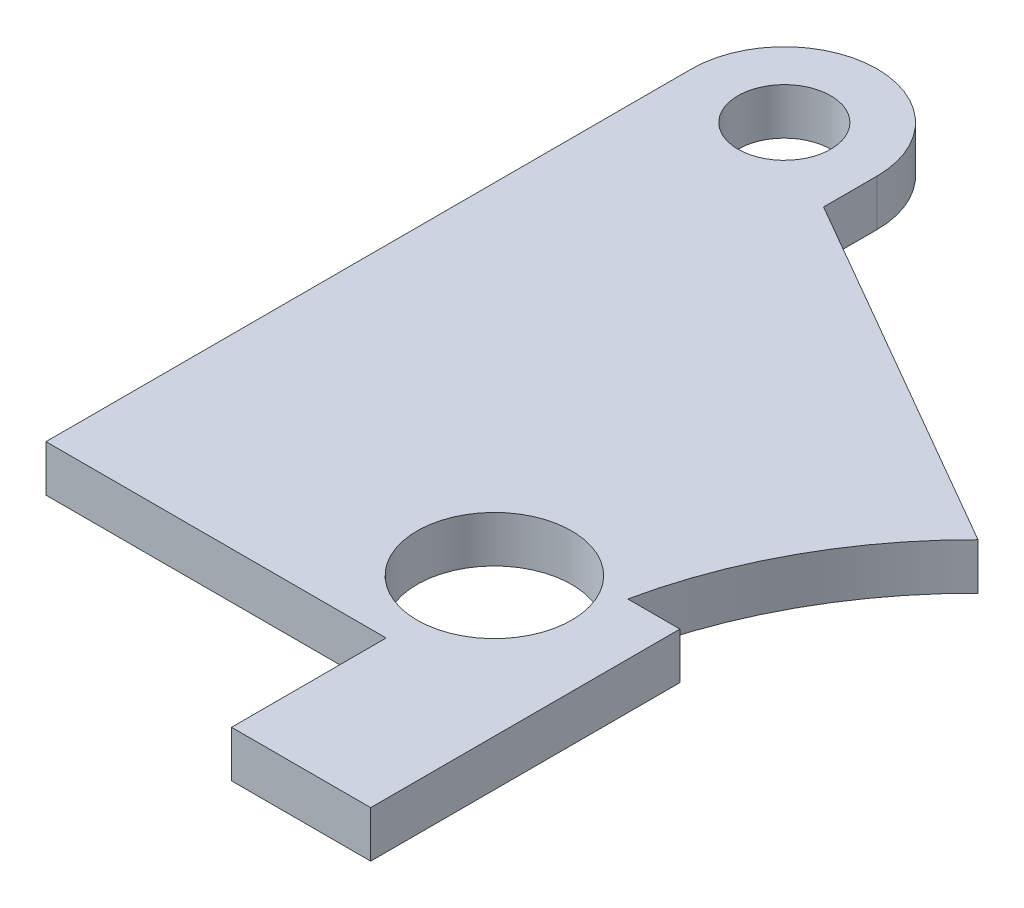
from build123d import *

# Parameters (mm, degrees)
SKETCH1_R      = 3
SKETCH1_R_2    = 5
EXTRUDE1_DEPTH = 3


with BuildPart() as part:
    # Sketch1 → Extrude1 (new body)
    with BuildSketch(Plane(origin=(0, 0, 0), x_dir=(1, 0, 0), z_dir=(0, 1, 0))):
        with BuildLine():
            Line((27.911530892, -0.094303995), (36.911530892, -0.094303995))
            Line((36.911530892, -0.094303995), (36.911530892, 19.905696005))
            Line((36.911530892, 19.905696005), (33.539008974, 19.905696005))
            ThreePointArc((33.539008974, 19.905696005), (36.465832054, 27.816713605), (41.545418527, 34.550827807))
            Line((41.545418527, 34.550827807), (17.911530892, 48.195859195))
            Line((17.911530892, 48.195859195), (17.911530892, 51.65996081))
            ThreePointArc((17.911530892, 51.65996081), (11.932762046, 57.659923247), (5.911681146, 51.702422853))
            Line((5.911681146, 51.702422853), (5.911681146, 9.905696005))
            Line((5.911681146, 9.905696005), (27.911530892, 9.905696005))
            Line((27.911530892, 9.905696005), (27.911530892, -0.094303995))
        make_face()
        with Locations(Location((11.911530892, 51.65996081, 0), (0, 0, 270))):
            Circle(SKETCH1_R, mode=Mode.SUBTRACT)
        with Locations(Location((27.911530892, 16.905696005, 0), (0, 0, 270))):
            Circle(SKETCH1_R_2, mode=Mode.SUBTRACT)
    extrude(amount=EXTRUDE1_DEPTH)


solid = part.part
